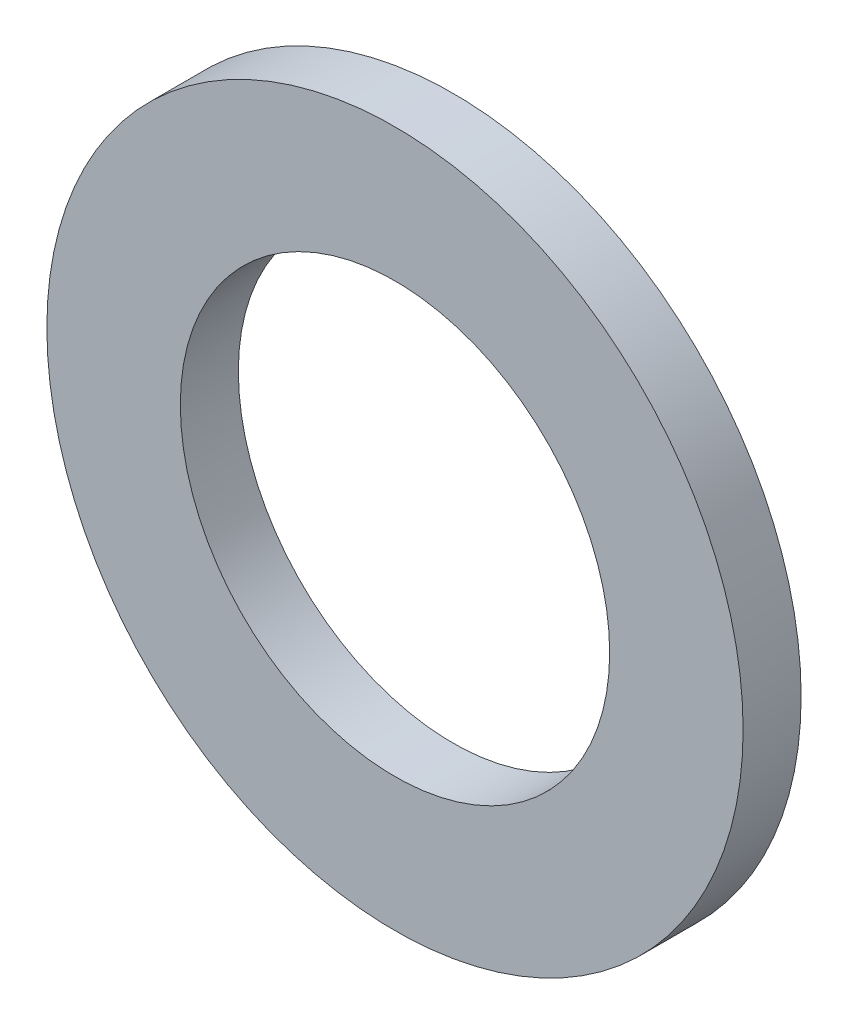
ISO-10303-21;
HEADER;
FILE_DESCRIPTION(('STEP AP214'),'2;1');
FILE_NAME('part.step','',(''),(''),'','','');
FILE_SCHEMA(('AUTOMOTIVE_DESIGN { 1 0 10303 214 1 1 1 1 }'));
ENDSEC;
DATA;
#1=APPLICATION_CONTEXT('core data for automotive mechanical design processes');
#2=APPLICATION_PROTOCOL_DEFINITION('international standard','automotive_design',2000,#1);
#3=PRODUCT_CONTEXT('',#1,'mechanical');
#4=PRODUCT('Part','Part','',(#3));
#5=PRODUCT_RELATED_PRODUCT_CATEGORY('part','',(#4));
#6=PRODUCT_DEFINITION_FORMATION('','',#4);
#7=PRODUCT_DEFINITION_CONTEXT('part definition',#1,'design');
#8=PRODUCT_DEFINITION('design','',#6,#7);
#9=PRODUCT_DEFINITION_SHAPE('','',#8);
#10=(LENGTH_UNIT() NAMED_UNIT(*) SI_UNIT(.MILLI.,.METRE.));
#11=(NAMED_UNIT(*) PLANE_ANGLE_UNIT() SI_UNIT($,.RADIAN.));
#12=(NAMED_UNIT(*) SI_UNIT($,.STERADIAN.) SOLID_ANGLE_UNIT());
#13=UNCERTAINTY_MEASURE_WITH_UNIT(LENGTH_MEASURE(1.E-05),#10,'distance_accuracy_value','');
#14=(GEOMETRIC_REPRESENTATION_CONTEXT(3) GLOBAL_UNCERTAINTY_ASSIGNED_CONTEXT((#13)) GLOBAL_UNIT_ASSIGNED_CONTEXT((#10,
#11,#12)) REPRESENTATION_CONTEXT('',''));
#15=CARTESIAN_POINT('',(0.,0.,0.));
#16=DIRECTION('',(0.,0.,1.));
#17=DIRECTION('',(1.,0.,0.));
#18=AXIS2_PLACEMENT_3D('',#15,#16,#17);
#19=CARTESIAN_POINT('',(0.,0.,6.35));
#20=DIRECTION('',(0.,0.,1.));
#21=DIRECTION('',(1.,0.,0.));
#22=AXIS2_PLACEMENT_3D('',#19,#20,#21);
#23=PLANE('',#22);
#24=CARTESIAN_POINT('',(0.,0.,6.35));
#25=DIRECTION('',(0.,0.,1.));
#26=DIRECTION('',(1.,0.,0.));
#27=AXIS2_PLACEMENT_3D('',#24,#25,#26);
#28=CIRCLE('',#27,38.1);
#29=CARTESIAN_POINT('',(38.1,0.,6.35));
#30=VERTEX_POINT('',#29);
#31=EDGE_CURVE('E10',#30,#30,#28,.T.);
#32=ORIENTED_EDGE('',*,*,#31,.T.);
#33=EDGE_LOOP('',(#32));
#34=FACE_BOUND('',#33,.T.);
#35=CARTESIAN_POINT('',(0.,0.,6.35));
#36=DIRECTION('',(0.,0.,1.));
#37=DIRECTION('',(1.,0.,0.));
#38=AXIS2_PLACEMENT_3D('',#35,#36,#37);
#39=CIRCLE('',#38,23.495);
#40=CARTESIAN_POINT('',(23.495,0.,6.35));
#41=VERTEX_POINT('',#40);
#42=EDGE_CURVE('E42',#41,#41,#39,.T.);
#43=ORIENTED_EDGE('',*,*,#42,.F.);
#44=EDGE_LOOP('',(#43));
#45=FACE_BOUND('',#44,.T.);
#46=ADVANCED_FACE('F31',(#34,#45),#23,.T.);
#47=CARTESIAN_POINT('',(0.,0.,0.));
#48=DIRECTION('',(0.,0.,1.));
#49=DIRECTION('',(1.,0.,0.));
#50=AXIS2_PLACEMENT_3D('',#47,#48,#49);
#51=PLANE('',#50);
#52=CARTESIAN_POINT('',(0.,0.,0.));
#53=DIRECTION('',(0.,0.,1.));
#54=DIRECTION('',(1.,0.,0.));
#55=AXIS2_PLACEMENT_3D('',#52,#53,#54);
#56=CIRCLE('',#55,38.1);
#57=CARTESIAN_POINT('',(38.1,0.,0.));
#58=VERTEX_POINT('',#57);
#59=EDGE_CURVE('E35',#58,#58,#56,.T.);
#60=ORIENTED_EDGE('',*,*,#59,.F.);
#61=EDGE_LOOP('',(#60));
#62=FACE_BOUND('',#61,.T.);
#63=CARTESIAN_POINT('',(0.,0.,0.));
#64=DIRECTION('',(0.,0.,1.));
#65=DIRECTION('',(1.,0.,0.));
#66=AXIS2_PLACEMENT_3D('',#63,#64,#65);
#67=CIRCLE('',#66,23.495);
#68=CARTESIAN_POINT('',(23.495,0.,0.));
#69=VERTEX_POINT('',#68);
#70=EDGE_CURVE('E44',#69,#69,#67,.T.);
#71=ORIENTED_EDGE('',*,*,#70,.T.);
#72=EDGE_LOOP('',(#71));
#73=FACE_BOUND('',#72,.T.);
#74=ADVANCED_FACE('F54',(#62,#73),#51,.F.);
#75=CARTESIAN_POINT('',(0.,0.,6.35));
#76=DIRECTION('',(0.,0.,-1.));
#77=DIRECTION('',(-1.,0.,0.));
#78=AXIS2_PLACEMENT_3D('',#75,#76,#77);
#79=CYLINDRICAL_SURFACE('',#78,38.1);
#80=ORIENTED_EDGE('',*,*,#31,.F.);
#81=EDGE_LOOP('',(#80));
#82=FACE_BOUND('',#81,.T.);
#83=ORIENTED_EDGE('',*,*,#59,.T.);
#84=EDGE_LOOP('',(#83));
#85=FACE_BOUND('',#84,.T.);
#86=ADVANCED_FACE('F33',(#82,#85),#79,.T.);
#87=CARTESIAN_POINT('',(0.,0.,6.35));
#88=DIRECTION('',(0.,0.,-1.));
#89=DIRECTION('',(-1.,0.,0.));
#90=AXIS2_PLACEMENT_3D('',#87,#88,#89);
#91=CYLINDRICAL_SURFACE('',#90,23.495);
#92=ORIENTED_EDGE('',*,*,#42,.T.);
#93=EDGE_LOOP('',(#92));
#94=FACE_BOUND('',#93,.T.);
#95=ORIENTED_EDGE('',*,*,#70,.F.);
#96=EDGE_LOOP('',(#95));
#97=FACE_BOUND('',#96,.T.);
#98=ADVANCED_FACE('F50',(#94,#97),#91,.F.);
#99=CLOSED_SHELL('',(#46,#74,#86,#98));
#100=MANIFOLD_SOLID_BREP('B2',#99);
#101=ADVANCED_BREP_SHAPE_REPRESENTATION('',(#18,#100),#14);
#102=SHAPE_DEFINITION_REPRESENTATION(#9,#101);
ENDSEC;
END-ISO-10303-21;
